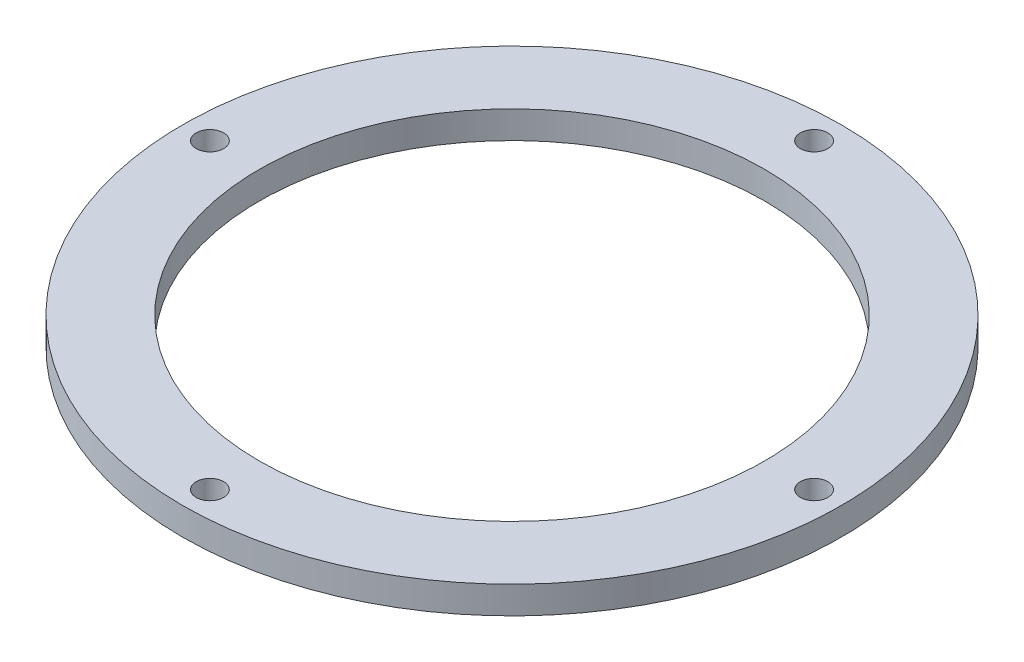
from build123d import *

# Parameters (mm, degrees)
SKETCH1_R           = 60
SKETCH1_R_2         = 46
BOSS_EXTRUDE1_DEPTH = 5
SKETCH2_R           = 2.5
CUT_EXTRUDE1_DEPTH  = 86


with BuildPart() as part:
    # Sketch1 → Boss-Extrude1 (new body)
    with BuildSketch(Plane(origin=(0, 0, 0), x_dir=(1, 0, 0), z_dir=(0, 1, 0))):
        with Locations(Location((0, 0, 0), (0, 0, 270))):
            Circle(SKETCH1_R)
        with Locations(Location((0, 0, 0), (0, 0, 270))):
            Circle(SKETCH1_R_2, mode=Mode.SUBTRACT)
    extrude(amount=BOSS_EXTRUDE1_DEPTH)

    # Sketch2 → Cut-Extrude1 (cut, through all)
    with BuildSketch(Plane(origin=(0, 5, 0), x_dir=(1, 0, 0), z_dir=(0, 1, 0))):
        with Locations(Location((0, 55, 0), (0, 0, 270))):
            Circle(SKETCH2_R)
        with Locations(Location((55, 0, 0), (0, 0, 270))):
            Circle(SKETCH2_R)
        with Locations(Location((0, -55, 0), (0, 0, 270))):
            Circle(SKETCH2_R)
        with Locations(Location((-55, 0, 0), (0, 0, 270))):
            Circle(SKETCH2_R)
    extrude(amount=-CUT_EXTRUDE1_DEPTH, mode=Mode.SUBTRACT)


solid = part.part
